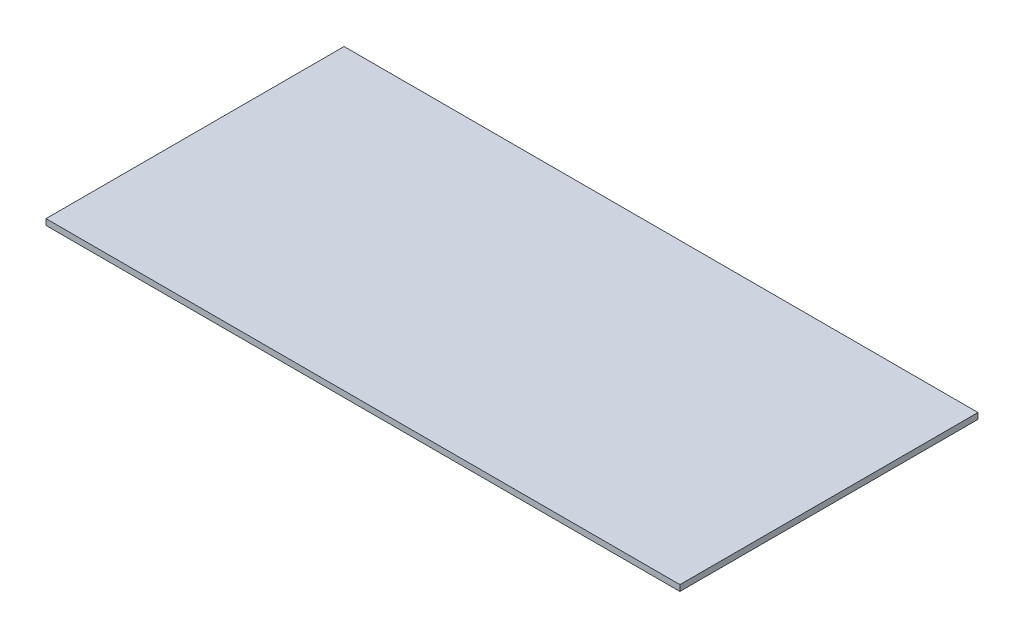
from build123d import *

# Parameters (mm, degrees)
SKETCH1_W           = 638
SKETCH1_H           = 300
BOSS_EXTRUDE1_DEPTH = 6


with BuildPart() as part:
    # Sketch1 → Boss-Extrude1 (new body)
    with BuildSketch(Plane(origin=(0, 0, 0), x_dir=(1, 0, 0), z_dir=(0, 1, 0))):
        Rectangle(SKETCH1_W, SKETCH1_H)
    extrude(amount=BOSS_EXTRUDE1_DEPTH)


solid = part.part
